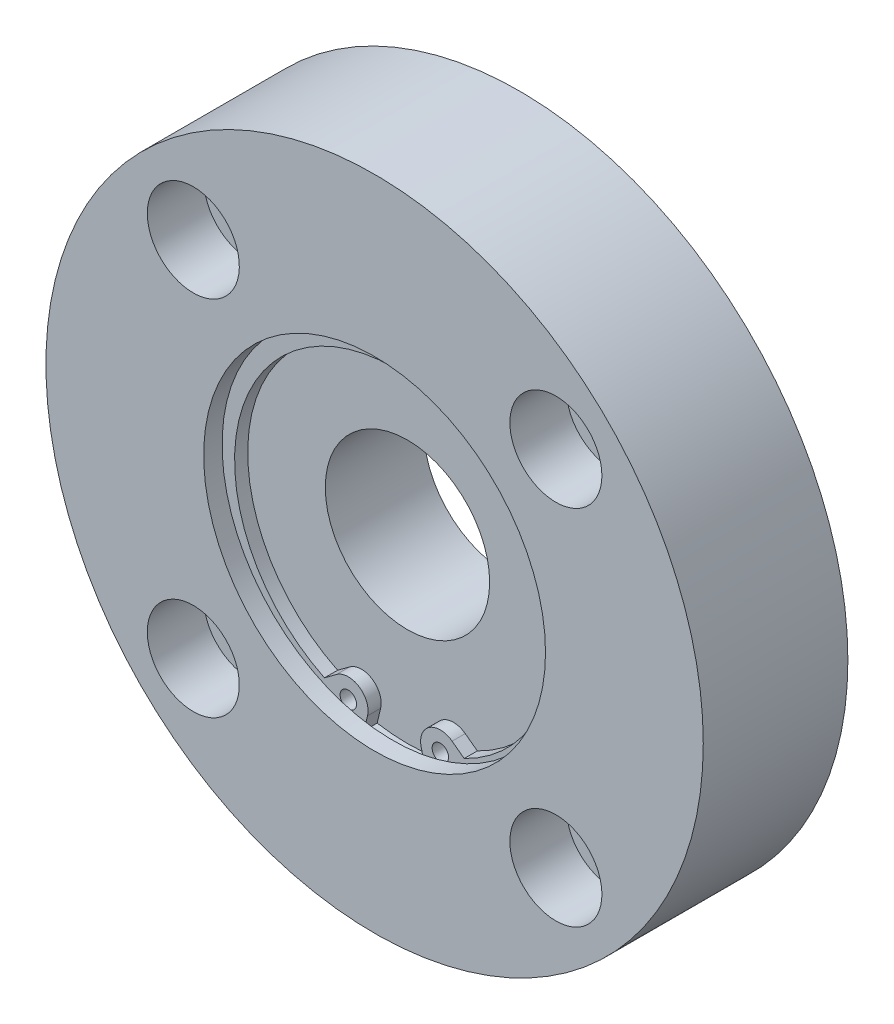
ISO-10303-21;
HEADER;
FILE_DESCRIPTION(('STEP AP214'),'2;1');
FILE_NAME('part.step','',(''),(''),'','','');
FILE_SCHEMA(('AUTOMOTIVE_DESIGN { 1 0 10303 214 1 1 1 1 }'));
ENDSEC;
DATA;
#1=APPLICATION_CONTEXT('core data for automotive mechanical design processes');
#2=APPLICATION_PROTOCOL_DEFINITION('international standard','automotive_design',2000,#1);
#3=PRODUCT_CONTEXT('',#1,'mechanical');
#4=PRODUCT('Part','Part','',(#3));
#5=PRODUCT_RELATED_PRODUCT_CATEGORY('part','',(#4));
#6=PRODUCT_DEFINITION_FORMATION('','',#4);
#7=PRODUCT_DEFINITION_CONTEXT('part definition',#1,'design');
#8=PRODUCT_DEFINITION('design','',#6,#7);
#9=PRODUCT_DEFINITION_SHAPE('','',#8);
#10=(LENGTH_UNIT() NAMED_UNIT(*) SI_UNIT(.MILLI.,.METRE.));
#11=(NAMED_UNIT(*) PLANE_ANGLE_UNIT() SI_UNIT($,.RADIAN.));
#12=(NAMED_UNIT(*) SI_UNIT($,.STERADIAN.) SOLID_ANGLE_UNIT());
#13=UNCERTAINTY_MEASURE_WITH_UNIT(LENGTH_MEASURE(1.E-05),#10,'distance_accuracy_value','');
#14=(GEOMETRIC_REPRESENTATION_CONTEXT(3) GLOBAL_UNCERTAINTY_ASSIGNED_CONTEXT((#13)) GLOBAL_UNIT_ASSIGNED_CONTEXT((#10,
#11,#12)) REPRESENTATION_CONTEXT('',''));
#15=CARTESIAN_POINT('',(0.,0.,0.));
#16=DIRECTION('',(0.,0.,1.));
#17=DIRECTION('',(1.,0.,0.));
#18=AXIS2_PLACEMENT_3D('',#15,#16,#17);
#19=CARTESIAN_POINT('',(27.5771644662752,27.5771644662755,0.));
#20=DIRECTION('',(0.,0.,1.));
#21=DIRECTION('',(1.,0.,0.));
#22=AXIS2_PLACEMENT_3D('',#19,#20,#21);
#23=CYLINDRICAL_SURFACE('',#22,5.);
#24=CARTESIAN_POINT('',(27.5771644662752,27.5771644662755,0.));
#25=DIRECTION('',(0.,0.,1.));
#26=DIRECTION('',(1.,0.,0.));
#27=AXIS2_PLACEMENT_3D('',#24,#25,#26);
#28=CIRCLE('',#27,5.);
#29=CARTESIAN_POINT('',(32.5771644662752,27.5771644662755,0.));
#30=VERTEX_POINT('',#29);
#31=EDGE_CURVE('E229',#30,#30,#28,.T.);
#32=ORIENTED_EDGE('',*,*,#31,.F.);
#33=EDGE_LOOP('',(#32));
#34=FACE_BOUND('',#33,.T.);
#35=CARTESIAN_POINT('',(27.5771644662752,27.5771644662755,13.4));
#36=DIRECTION('',(0.,0.,1.));
#37=DIRECTION('',(1.,0.,0.));
#38=AXIS2_PLACEMENT_3D('',#35,#36,#37);
#39=CIRCLE('',#38,5.);
#40=CARTESIAN_POINT('',(32.5771644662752,27.5771644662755,13.4));
#41=VERTEX_POINT('',#40);
#42=EDGE_CURVE('E228',#41,#41,#39,.F.);
#43=ORIENTED_EDGE('',*,*,#42,.F.);
#44=EDGE_LOOP('',(#43));
#45=FACE_BOUND('',#44,.T.);
#46=ADVANCED_FACE('F14',(#34,#45),#23,.F.);
#47=CARTESIAN_POINT('',(27.5771644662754,-27.5771644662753,0.));
#48=DIRECTION('',(0.,0.,1.));
#49=DIRECTION('',(1.,0.,0.));
#50=AXIS2_PLACEMENT_3D('',#47,#48,#49);
#51=CYLINDRICAL_SURFACE('',#50,5.);
#52=CARTESIAN_POINT('',(27.5771644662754,-27.5771644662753,0.));
#53=DIRECTION('',(0.,0.,1.));
#54=DIRECTION('',(0.,-1.,0.));
#55=AXIS2_PLACEMENT_3D('',#52,#53,#54);
#56=CIRCLE('',#55,5.);
#57=CARTESIAN_POINT('',(27.5771644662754,-32.5771644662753,0.));
#58=VERTEX_POINT('',#57);
#59=EDGE_CURVE('E219',#58,#58,#56,.T.);
#60=ORIENTED_EDGE('',*,*,#59,.F.);
#61=EDGE_LOOP('',(#60));
#62=FACE_BOUND('',#61,.T.);
#63=CARTESIAN_POINT('',(27.5771644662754,-27.5771644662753,13.4));
#64=DIRECTION('',(0.,0.,1.));
#65=DIRECTION('',(1.,0.,0.));
#66=AXIS2_PLACEMENT_3D('',#63,#64,#65);
#67=CIRCLE('',#66,5.);
#68=CARTESIAN_POINT('',(32.5771644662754,-27.5771644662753,13.4));
#69=VERTEX_POINT('',#68);
#70=EDGE_CURVE('E212',#69,#69,#67,.F.);
#71=ORIENTED_EDGE('',*,*,#70,.F.);
#72=EDGE_LOOP('',(#71));
#73=FACE_BOUND('',#72,.T.);
#74=ADVANCED_FACE('F319',(#62,#73),#51,.F.);
#75=CARTESIAN_POINT('',(-27.5771644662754,-27.5771644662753,0.));
#76=DIRECTION('',(0.,0.,1.));
#77=DIRECTION('',(1.,0.,0.));
#78=AXIS2_PLACEMENT_3D('',#75,#76,#77);
#79=CYLINDRICAL_SURFACE('',#78,5.);
#80=CARTESIAN_POINT('',(-27.5771644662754,-27.5771644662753,0.));
#81=DIRECTION('',(0.,0.,1.));
#82=DIRECTION('',(-1.,0.,0.));
#83=AXIS2_PLACEMENT_3D('',#80,#81,#82);
#84=CIRCLE('',#83,5.);
#85=CARTESIAN_POINT('',(-32.5771644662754,-27.5771644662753,0.));
#86=VERTEX_POINT('',#85);
#87=EDGE_CURVE('E216',#86,#86,#84,.T.);
#88=ORIENTED_EDGE('',*,*,#87,.F.);
#89=EDGE_LOOP('',(#88));
#90=FACE_BOUND('',#89,.T.);
#91=CARTESIAN_POINT('',(-27.5771644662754,-27.5771644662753,13.4));
#92=DIRECTION('',(0.,0.,1.));
#93=DIRECTION('',(1.,0.,0.));
#94=AXIS2_PLACEMENT_3D('',#91,#92,#93);
#95=CIRCLE('',#94,5.);
#96=CARTESIAN_POINT('',(-22.5771644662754,-27.5771644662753,13.4));
#97=VERTEX_POINT('',#96);
#98=EDGE_CURVE('E205',#97,#97,#95,.F.);
#99=ORIENTED_EDGE('',*,*,#98,.F.);
#100=EDGE_LOOP('',(#99));
#101=FACE_BOUND('',#100,.T.);
#102=ADVANCED_FACE('F325',(#90,#101),#79,.F.);
#103=CARTESIAN_POINT('',(-27.5771644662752,27.5771644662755,0.));
#104=DIRECTION('',(0.,0.,1.));
#105=DIRECTION('',(1.,0.,0.));
#106=AXIS2_PLACEMENT_3D('',#103,#104,#105);
#107=CYLINDRICAL_SURFACE('',#106,5.);
#108=CARTESIAN_POINT('',(-27.5771644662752,27.5771644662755,0.));
#109=DIRECTION('',(0.,0.,1.));
#110=DIRECTION('',(0.,1.,0.));
#111=AXIS2_PLACEMENT_3D('',#108,#109,#110);
#112=CIRCLE('',#111,5.);
#113=CARTESIAN_POINT('',(-27.5771644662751,32.5771644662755,0.));
#114=VERTEX_POINT('',#113);
#115=EDGE_CURVE('E213',#114,#114,#112,.T.);
#116=ORIENTED_EDGE('',*,*,#115,.F.);
#117=EDGE_LOOP('',(#116));
#118=FACE_BOUND('',#117,.T.);
#119=CARTESIAN_POINT('',(-27.5771644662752,27.5771644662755,13.4));
#120=DIRECTION('',(0.,0.,1.));
#121=DIRECTION('',(1.,0.,0.));
#122=AXIS2_PLACEMENT_3D('',#119,#120,#121);
#123=CIRCLE('',#122,5.);
#124=CARTESIAN_POINT('',(-22.5771644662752,27.5771644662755,13.4));
#125=VERTEX_POINT('',#124);
#126=EDGE_CURVE('E198',#125,#125,#123,.F.);
#127=ORIENTED_EDGE('',*,*,#126,.F.);
#128=EDGE_LOOP('',(#127));
#129=FACE_BOUND('',#128,.T.);
#130=ADVANCED_FACE('F421',(#118,#129),#107,.F.);
#131=CARTESIAN_POINT('',(27.5771644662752,27.5771644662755,13.4));
#132=DIRECTION('',(0.,0.,1.));
#133=DIRECTION('',(1.,0.,0.));
#134=AXIS2_PLACEMENT_3D('',#131,#132,#133);
#135=PLANE('',#134);
#136=CARTESIAN_POINT('',(27.5771644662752,27.5771644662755,13.4));
#137=DIRECTION('',(0.,0.,1.));
#138=DIRECTION('',(1.,0.,0.));
#139=AXIS2_PLACEMENT_3D('',#136,#137,#138);
#140=CIRCLE('',#139,7.);
#141=CARTESIAN_POINT('',(34.5771644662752,27.5771644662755,13.4));
#142=VERTEX_POINT('',#141);
#143=EDGE_CURVE('E225',#142,#142,#140,.T.);
#144=ORIENTED_EDGE('',*,*,#143,.T.);
#145=EDGE_LOOP('',(#144));
#146=FACE_BOUND('',#145,.T.);
#147=ORIENTED_EDGE('',*,*,#42,.T.);
#148=EDGE_LOOP('',(#147));
#149=FACE_BOUND('',#148,.T.);
#150=ADVANCED_FACE('F412',(#146,#149),#135,.T.);
#151=CARTESIAN_POINT('',(27.5771644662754,-27.5771644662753,13.4));
#152=DIRECTION('',(0.,0.,1.));
#153=DIRECTION('',(0.,-1.,0.));
#154=AXIS2_PLACEMENT_3D('',#151,#152,#153);
#155=PLANE('',#154);
#156=CARTESIAN_POINT('',(27.5771644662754,-27.5771644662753,13.4));
#157=DIRECTION('',(0.,0.,1.));
#158=DIRECTION('',(0.,-1.,0.));
#159=AXIS2_PLACEMENT_3D('',#156,#157,#158);
#160=CIRCLE('',#159,7.);
#161=CARTESIAN_POINT('',(27.5771644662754,-34.5771644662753,13.4));
#162=VERTEX_POINT('',#161);
#163=EDGE_CURVE('E209',#162,#162,#160,.T.);
#164=ORIENTED_EDGE('',*,*,#163,.T.);
#165=EDGE_LOOP('',(#164));
#166=FACE_BOUND('',#165,.T.);
#167=ORIENTED_EDGE('',*,*,#70,.T.);
#168=EDGE_LOOP('',(#167));
#169=FACE_BOUND('',#168,.T.);
#170=ADVANCED_FACE('F409',(#166,#169),#155,.T.);
#171=CARTESIAN_POINT('',(-27.5771644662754,-27.5771644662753,13.4));
#172=DIRECTION('',(0.,0.,1.));
#173=DIRECTION('',(-1.,0.,0.));
#174=AXIS2_PLACEMENT_3D('',#171,#172,#173);
#175=PLANE('',#174);
#176=CARTESIAN_POINT('',(-27.5771644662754,-27.5771644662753,13.4));
#177=DIRECTION('',(0.,0.,1.));
#178=DIRECTION('',(-1.,0.,0.));
#179=AXIS2_PLACEMENT_3D('',#176,#177,#178);
#180=CIRCLE('',#179,7.);
#181=CARTESIAN_POINT('',(-34.5771644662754,-27.5771644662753,13.4));
#182=VERTEX_POINT('',#181);
#183=EDGE_CURVE('E202',#182,#182,#180,.T.);
#184=ORIENTED_EDGE('',*,*,#183,.T.);
#185=EDGE_LOOP('',(#184));
#186=FACE_BOUND('',#185,.T.);
#187=ORIENTED_EDGE('',*,*,#98,.T.);
#188=EDGE_LOOP('',(#187));
#189=FACE_BOUND('',#188,.T.);
#190=ADVANCED_FACE('F411',(#186,#189),#175,.T.);
#191=CARTESIAN_POINT('',(-27.5771644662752,27.5771644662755,13.4));
#192=DIRECTION('',(0.,0.,1.));
#193=DIRECTION('',(0.,1.,0.));
#194=AXIS2_PLACEMENT_3D('',#191,#192,#193);
#195=PLANE('',#194);
#196=CARTESIAN_POINT('',(-27.5771644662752,27.5771644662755,13.4));
#197=DIRECTION('',(0.,0.,1.));
#198=DIRECTION('',(0.,1.,0.));
#199=AXIS2_PLACEMENT_3D('',#196,#197,#198);
#200=CIRCLE('',#199,7.);
#201=CARTESIAN_POINT('',(-27.5771644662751,34.5771644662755,13.4));
#202=VERTEX_POINT('',#201);
#203=EDGE_CURVE('E195',#202,#202,#200,.T.);
#204=ORIENTED_EDGE('',*,*,#203,.T.);
#205=EDGE_LOOP('',(#204));
#206=FACE_BOUND('',#205,.T.);
#207=ORIENTED_EDGE('',*,*,#126,.T.);
#208=EDGE_LOOP('',(#207));
#209=FACE_BOUND('',#208,.T.);
#210=ADVANCED_FACE('F343',(#206,#209),#195,.T.);
#211=CARTESIAN_POINT('',(0.,0.,0.));
#212=DIRECTION('',(0.,0.,1.));
#213=DIRECTION('',(1.,0.,0.));
#214=AXIS2_PLACEMENT_3D('',#211,#212,#213);
#215=PLANE('',#214);
#216=CARTESIAN_POINT('',(0.,0.,0.));
#217=DIRECTION('',(0.,0.,-1.));
#218=DIRECTION('',(-1.,0.,0.));
#219=AXIS2_PLACEMENT_3D('',#216,#217,#218);
#220=CIRCLE('',#219,22.5);
#221=CARTESIAN_POINT('',(-22.5,0.,0.));
#222=VERTEX_POINT('',#221);
#223=EDGE_CURVE('E181',#222,#222,#220,.T.);
#224=ORIENTED_EDGE('',*,*,#223,.F.);
#225=EDGE_LOOP('',(#224));
#226=FACE_BOUND('',#225,.T.);
#227=ORIENTED_EDGE('',*,*,#115,.T.);
#228=EDGE_LOOP('',(#227));
#229=FACE_BOUND('',#228,.T.);
#230=ORIENTED_EDGE('',*,*,#87,.T.);
#231=EDGE_LOOP('',(#230));
#232=FACE_BOUND('',#231,.T.);
#233=ORIENTED_EDGE('',*,*,#59,.T.);
#234=EDGE_LOOP('',(#233));
#235=FACE_BOUND('',#234,.T.);
#236=ORIENTED_EDGE('',*,*,#31,.T.);
#237=EDGE_LOOP('',(#236));
#238=FACE_BOUND('',#237,.T.);
#239=CARTESIAN_POINT('',(0.,0.,0.));
#240=DIRECTION('',(0.,0.,1.));
#241=DIRECTION('',(1.,0.,0.));
#242=AXIS2_PLACEMENT_3D('',#239,#240,#241);
#243=CIRCLE('',#242,50.);
#244=CARTESIAN_POINT('',(50.,0.,0.));
#245=VERTEX_POINT('',#244);
#246=EDGE_CURVE('E232',#245,#245,#243,.T.);
#247=ORIENTED_EDGE('',*,*,#246,.F.);
#248=EDGE_LOOP('',(#247));
#249=FACE_BOUND('',#248,.T.);
#250=ADVANCED_FACE('F339',(#226,#229,#232,#235,#238,#249),#215,.F.);
#251=CARTESIAN_POINT('',(0.,0.,22.));
#252=DIRECTION('',(0.,0.,-1.));
#253=DIRECTION('',(-1.,0.,0.));
#254=AXIS2_PLACEMENT_3D('',#251,#252,#253);
#255=CYLINDRICAL_SURFACE('',#254,50.);
#256=CARTESIAN_POINT('',(0.,0.,22.));
#257=DIRECTION('',(0.,0.,1.));
#258=DIRECTION('',(1.,0.,0.));
#259=AXIS2_PLACEMENT_3D('',#256,#257,#258);
#260=CIRCLE('',#259,50.);
#261=CARTESIAN_POINT('',(50.,0.,22.));
#262=VERTEX_POINT('',#261);
#263=EDGE_CURVE('E235',#262,#262,#260,.T.);
#264=ORIENTED_EDGE('',*,*,#263,.F.);
#265=EDGE_LOOP('',(#264));
#266=FACE_BOUND('',#265,.T.);
#267=ORIENTED_EDGE('',*,*,#246,.T.);
#268=EDGE_LOOP('',(#267));
#269=FACE_BOUND('',#268,.T.);
#270=ADVANCED_FACE('F342',(#266,#269),#255,.T.);
#271=CARTESIAN_POINT('',(27.5771644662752,27.5771644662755,13.4));
#272=DIRECTION('',(0.,0.,1.));
#273=DIRECTION('',(1.,0.,0.));
#274=AXIS2_PLACEMENT_3D('',#271,#272,#273);
#275=CYLINDRICAL_SURFACE('',#274,7.);
#276=ORIENTED_EDGE('',*,*,#143,.F.);
#277=EDGE_LOOP('',(#276));
#278=FACE_BOUND('',#277,.T.);
#279=CARTESIAN_POINT('',(27.5771644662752,27.5771644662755,22.));
#280=DIRECTION('',(0.,0.,1.));
#281=DIRECTION('',(1.,0.,0.));
#282=AXIS2_PLACEMENT_3D('',#279,#280,#281);
#283=CIRCLE('',#282,7.);
#284=CARTESIAN_POINT('',(34.5771644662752,27.5771644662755,22.));
#285=VERTEX_POINT('',#284);
#286=EDGE_CURVE('E222',#285,#285,#283,.T.);
#287=ORIENTED_EDGE('',*,*,#286,.T.);
#288=EDGE_LOOP('',(#287));
#289=FACE_BOUND('',#288,.T.);
#290=ADVANCED_FACE('F332',(#278,#289),#275,.F.);
#291=CARTESIAN_POINT('',(27.5771644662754,-27.5771644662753,13.4));
#292=DIRECTION('',(0.,0.,1.));
#293=DIRECTION('',(1.,0.,0.));
#294=AXIS2_PLACEMENT_3D('',#291,#292,#293);
#295=CYLINDRICAL_SURFACE('',#294,7.);
#296=ORIENTED_EDGE('',*,*,#163,.F.);
#297=EDGE_LOOP('',(#296));
#298=FACE_BOUND('',#297,.T.);
#299=CARTESIAN_POINT('',(27.5771644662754,-27.5771644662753,22.));
#300=DIRECTION('',(0.,0.,1.));
#301=DIRECTION('',(0.,-1.,0.));
#302=AXIS2_PLACEMENT_3D('',#299,#300,#301);
#303=CIRCLE('',#302,7.);
#304=CARTESIAN_POINT('',(27.5771644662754,-34.5771644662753,22.));
#305=VERTEX_POINT('',#304);
#306=EDGE_CURVE('E206',#305,#305,#303,.T.);
#307=ORIENTED_EDGE('',*,*,#306,.T.);
#308=EDGE_LOOP('',(#307));
#309=FACE_BOUND('',#308,.T.);
#310=ADVANCED_FACE('F426',(#298,#309),#295,.F.);
#311=CARTESIAN_POINT('',(-27.5771644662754,-27.5771644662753,13.4));
#312=DIRECTION('',(0.,0.,1.));
#313=DIRECTION('',(1.,0.,0.));
#314=AXIS2_PLACEMENT_3D('',#311,#312,#313);
#315=CYLINDRICAL_SURFACE('',#314,7.);
#316=ORIENTED_EDGE('',*,*,#183,.F.);
#317=EDGE_LOOP('',(#316));
#318=FACE_BOUND('',#317,.T.);
#319=CARTESIAN_POINT('',(-27.5771644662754,-27.5771644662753,22.));
#320=DIRECTION('',(0.,0.,1.));
#321=DIRECTION('',(-1.,0.,0.));
#322=AXIS2_PLACEMENT_3D('',#319,#320,#321);
#323=CIRCLE('',#322,7.);
#324=CARTESIAN_POINT('',(-34.5771644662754,-27.5771644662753,22.));
#325=VERTEX_POINT('',#324);
#326=EDGE_CURVE('E199',#325,#325,#323,.T.);
#327=ORIENTED_EDGE('',*,*,#326,.T.);
#328=EDGE_LOOP('',(#327));
#329=FACE_BOUND('',#328,.T.);
#330=ADVANCED_FACE('F425',(#318,#329),#315,.F.);
#331=CARTESIAN_POINT('',(-27.5771644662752,27.5771644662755,13.4));
#332=DIRECTION('',(0.,0.,1.));
#333=DIRECTION('',(1.,0.,0.));
#334=AXIS2_PLACEMENT_3D('',#331,#332,#333);
#335=CYLINDRICAL_SURFACE('',#334,7.);
#336=ORIENTED_EDGE('',*,*,#203,.F.);
#337=EDGE_LOOP('',(#336));
#338=FACE_BOUND('',#337,.T.);
#339=CARTESIAN_POINT('',(-27.5771644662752,27.5771644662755,22.));
#340=DIRECTION('',(0.,0.,1.));
#341=DIRECTION('',(0.,1.,0.));
#342=AXIS2_PLACEMENT_3D('',#339,#340,#341);
#343=CIRCLE('',#342,7.);
#344=CARTESIAN_POINT('',(-27.5771644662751,34.5771644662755,22.));
#345=VERTEX_POINT('',#344);
#346=EDGE_CURVE('E192',#345,#345,#343,.T.);
#347=ORIENTED_EDGE('',*,*,#346,.T.);
#348=EDGE_LOOP('',(#347));
#349=FACE_BOUND('',#348,.T.);
#350=ADVANCED_FACE('F394',(#338,#349),#335,.F.);
#351=CARTESIAN_POINT('',(0.,0.,2.));
#352=DIRECTION('',(0.,0.,-1.));
#353=DIRECTION('',(-1.,0.,0.));
#354=AXIS2_PLACEMENT_3D('',#351,#352,#353);
#355=CYLINDRICAL_SURFACE('',#354,22.5);
#356=CARTESIAN_POINT('',(0.,0.,2.));
#357=DIRECTION('',(0.,0.,-1.));
#358=DIRECTION('',(-1.,0.,0.));
#359=AXIS2_PLACEMENT_3D('',#356,#357,#358);
#360=CIRCLE('',#359,22.5);
#361=CARTESIAN_POINT('',(-22.5,0.,2.));
#362=VERTEX_POINT('',#361);
#363=EDGE_CURVE('E184',#362,#362,#360,.T.);
#364=ORIENTED_EDGE('',*,*,#363,.F.);
#365=EDGE_LOOP('',(#364));
#366=FACE_BOUND('',#365,.T.);
#367=ORIENTED_EDGE('',*,*,#223,.T.);
#368=EDGE_LOOP('',(#367));
#369=FACE_BOUND('',#368,.T.);
#370=ADVANCED_FACE('F349',(#366,#369),#355,.F.);
#371=CARTESIAN_POINT('',(0.,0.,22.));
#372=DIRECTION('',(0.,0.,1.));
#373=DIRECTION('',(1.,0.,0.));
#374=AXIS2_PLACEMENT_3D('',#371,#372,#373);
#375=PLANE('',#374);
#376=CARTESIAN_POINT('',(0.,0.,22.));
#377=DIRECTION('',(0.,0.,1.));
#378=DIRECTION('',(1.,0.,0.));
#379=AXIS2_PLACEMENT_3D('',#376,#377,#378);
#380=CIRCLE('',#379,26.);
#381=CARTESIAN_POINT('',(26.,0.,22.));
#382=VERTEX_POINT('',#381);
#383=EDGE_CURVE('E188',#382,#382,#380,.T.);
#384=ORIENTED_EDGE('',*,*,#383,.F.);
#385=EDGE_LOOP('',(#384));
#386=FACE_BOUND('',#385,.T.);
#387=ORIENTED_EDGE('',*,*,#346,.F.);
#388=EDGE_LOOP('',(#387));
#389=FACE_BOUND('',#388,.T.);
#390=ORIENTED_EDGE('',*,*,#326,.F.);
#391=EDGE_LOOP('',(#390));
#392=FACE_BOUND('',#391,.T.);
#393=ORIENTED_EDGE('',*,*,#306,.F.);
#394=EDGE_LOOP('',(#393));
#395=FACE_BOUND('',#394,.T.);
#396=ORIENTED_EDGE('',*,*,#286,.F.);
#397=EDGE_LOOP('',(#396));
#398=FACE_BOUND('',#397,.T.);
#399=ORIENTED_EDGE('',*,*,#263,.T.);
#400=EDGE_LOOP('',(#399));
#401=FACE_BOUND('',#400,.T.);
#402=ADVANCED_FACE('F345',(#386,#389,#392,#395,#398,#401),#375,.T.);
#403=CARTESIAN_POINT('',(0.,0.,2.));
#404=DIRECTION('',(0.,0.,-1.));
#405=DIRECTION('',(-1.,0.,0.));
#406=AXIS2_PLACEMENT_3D('',#403,#404,#405);
#407=PLANE('',#406);
#408=CARTESIAN_POINT('',(0.,0.,2.));
#409=DIRECTION('',(0.,0.,-1.));
#410=DIRECTION('',(-1.,0.,0.));
#411=AXIS2_PLACEMENT_3D('',#408,#409,#410);
#412=CIRCLE('',#411,12.5);
#413=CARTESIAN_POINT('',(-12.5,0.,2.));
#414=VERTEX_POINT('',#413);
#415=EDGE_CURVE('E187',#414,#414,#412,.T.);
#416=ORIENTED_EDGE('',*,*,#415,.F.);
#417=EDGE_LOOP('',(#416));
#418=FACE_BOUND('',#417,.T.);
#419=ORIENTED_EDGE('',*,*,#363,.T.);
#420=EDGE_LOOP('',(#419));
#421=FACE_BOUND('',#420,.T.);
#422=ADVANCED_FACE('F348',(#418,#421),#407,.T.);
#423=CARTESIAN_POINT('',(0.,0.,17.));
#424=DIRECTION('',(0.,0.,1.));
#425=DIRECTION('',(1.,0.,0.));
#426=AXIS2_PLACEMENT_3D('',#423,#424,#425);
#427=CYLINDRICAL_SURFACE('',#426,26.);
#428=CARTESIAN_POINT('',(0.,0.,19.2));
#429=DIRECTION('',(0.,0.,1.));
#430=DIRECTION('',(1.,0.,0.));
#431=AXIS2_PLACEMENT_3D('',#428,#429,#430);
#432=CIRCLE('',#431,26.);
#433=CARTESIAN_POINT('',(26.,0.,19.2));
#434=VERTEX_POINT('',#433);
#435=EDGE_CURVE('E178',#434,#434,#432,.F.);
#436=ORIENTED_EDGE('',*,*,#435,.T.);
#437=EDGE_LOOP('',(#436));
#438=FACE_BOUND('',#437,.T.);
#439=ORIENTED_EDGE('',*,*,#383,.T.);
#440=EDGE_LOOP('',(#439));
#441=FACE_BOUND('',#440,.T.);
#442=ADVANCED_FACE('F337',(#438,#441),#427,.F.);
#443=CARTESIAN_POINT('',(0.,0.,22.));
#444=DIRECTION('',(0.,0.,-1.));
#445=DIRECTION('',(-1.,0.,0.));
#446=AXIS2_PLACEMENT_3D('',#443,#444,#445);
#447=CYLINDRICAL_SURFACE('',#446,12.5);
#448=CARTESIAN_POINT('',(0.,0.,17.));
#449=DIRECTION('',(0.,0.,1.));
#450=DIRECTION('',(1.,0.,0.));
#451=AXIS2_PLACEMENT_3D('',#448,#449,#450);
#452=CIRCLE('',#451,12.5);
#453=CARTESIAN_POINT('',(12.5,0.,17.));
#454=VERTEX_POINT('',#453);
#455=EDGE_CURVE('E191',#454,#454,#452,.T.);
#456=ORIENTED_EDGE('',*,*,#455,.T.);
#457=EDGE_LOOP('',(#456));
#458=FACE_BOUND('',#457,.T.);
#459=ORIENTED_EDGE('',*,*,#415,.T.);
#460=EDGE_LOOP('',(#459));
#461=FACE_BOUND('',#460,.T.);
#462=ADVANCED_FACE('F334',(#458,#461),#447,.F.);
#463=CARTESIAN_POINT('',(0.,0.,17.));
#464=DIRECTION('',(0.,0.,1.));
#465=DIRECTION('',(1.,0.,0.));
#466=AXIS2_PLACEMENT_3D('',#463,#464,#465);
#467=PLANE('',#466);
#468=ORIENTED_EDGE('',*,*,#455,.F.);
#469=EDGE_LOOP('',(#468));
#470=FACE_BOUND('',#469,.T.);
#471=CARTESIAN_POINT('',(0.,0.,17.));
#472=DIRECTION('',(0.,0.,1.));
#473=DIRECTION('',(1.,0.,0.));
#474=AXIS2_PLACEMENT_3D('',#471,#472,#473);
#475=CIRCLE('',#474,27.5);
#476=CARTESIAN_POINT('',(-4.60954752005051,-27.1109216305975,17.));
#477=VERTEX_POINT('',#476);
#478=CARTESIAN_POINT('',(4.60954752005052,-27.1109216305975,17.));
#479=VERTEX_POINT('',#478);
#480=EDGE_CURVE('E97',#477,#479,#475,.T.);
#481=ORIENTED_EDGE('',*,*,#480,.T.);
#482=DIRECTION('',(-0.231349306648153,0.972870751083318,0.));
#483=VECTOR('',#482,1.);
#484=CARTESIAN_POINT('',(-1.73910274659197,-0.413559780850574,17.));
#485=LINE('',#484,#483);
#486=CARTESIAN_POINT('',(4.08138774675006,-24.8899026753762,17.));
#487=VERTEX_POINT('',#486);
#488=EDGE_CURVE('E9',#479,#487,#485,.T.);
#489=ORIENTED_EDGE('',*,*,#488,.T.);
#490=CARTESIAN_POINT('',(7.,-24.1958547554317,17.));
#491=DIRECTION('',(0.,0.,1.));
#492=DIRECTION('',(1.,0.,0.));
#493=AXIS2_PLACEMENT_3D('',#490,#491,#492);
#494=CIRCLE('',#493,3.);
#495=CARTESIAN_POINT('',(8.7896612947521,-21.7881354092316,17.));
#496=VERTEX_POINT('',#495);
#497=EDGE_CURVE('E25',#496,#487,#494,.T.);
#498=ORIENTED_EDGE('',*,*,#497,.F.);
#499=DIRECTION('',(0.802573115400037,-0.596553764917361,0.));
#500=VECTOR('',#499,1.);
#501=CARTESIAN_POINT('',(-7.30364722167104,-9.82595576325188,17.));
#502=LINE('',#501,#500);
#503=CARTESIAN_POINT('',(10.6263840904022,-23.1533741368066,17.));
#504=VERTEX_POINT('',#503);
#505=EDGE_CURVE('E269',#496,#504,#502,.T.);
#506=ORIENTED_EDGE('',*,*,#505,.T.);
#507=CARTESIAN_POINT('',(0.,-1.3,17.));
#508=DIRECTION('',(0.,0.,1.));
#509=DIRECTION('',(1.,0.,0.));
#510=AXIS2_PLACEMENT_3D('',#507,#508,#509);
#511=CIRCLE('',#510,24.3);
#512=CARTESIAN_POINT('',(-10.6263840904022,-23.1533741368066,17.));
#513=VERTEX_POINT('',#512);
#514=EDGE_CURVE('E133',#504,#513,#511,.T.);
#515=ORIENTED_EDGE('',*,*,#514,.T.);
#516=DIRECTION('',(0.802573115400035,0.596553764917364,0.));
#517=VECTOR('',#516,1.);
#518=CARTESIAN_POINT('',(7.30364722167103,-9.8259557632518,17.));
#519=LINE('',#518,#517);
#520=CARTESIAN_POINT('',(-8.7896612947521,-21.7881354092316,17.));
#521=VERTEX_POINT('',#520);
#522=EDGE_CURVE('E265',#513,#521,#519,.T.);
#523=ORIENTED_EDGE('',*,*,#522,.T.);
#524=CARTESIAN_POINT('',(-7.,-24.1958547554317,17.));
#525=DIRECTION('',(0.,0.,1.));
#526=DIRECTION('',(1.,0.,0.));
#527=AXIS2_PLACEMENT_3D('',#524,#525,#526);
#528=CIRCLE('',#527,3.);
#529=CARTESIAN_POINT('',(-4.08138774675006,-24.8899026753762,17.));
#530=VERTEX_POINT('',#529);
#531=EDGE_CURVE('E95',#530,#521,#528,.T.);
#532=ORIENTED_EDGE('',*,*,#531,.F.);
#533=DIRECTION('',(-0.231349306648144,-0.97287075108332,0.));
#534=VECTOR('',#533,1.);
#535=CARTESIAN_POINT('',(1.73910274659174,-0.413559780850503,17.));
#536=LINE('',#535,#534);
#537=EDGE_CURVE('E174',#530,#477,#536,.T.);
#538=ORIENTED_EDGE('',*,*,#537,.T.);
#539=EDGE_LOOP('',(#481,#489,#498,#506,#515,#523,#532,#538));
#540=FACE_BOUND('',#539,.T.);
#541=ADVANCED_FACE('F172',(#470,#540),#467,.T.);
#542=CARTESIAN_POINT('',(0.,0.,19.2));
#543=DIRECTION('',(0.,0.,1.));
#544=DIRECTION('',(1.,0.,0.));
#545=AXIS2_PLACEMENT_3D('',#542,#543,#544);
#546=PLANE('',#545);
#547=CARTESIAN_POINT('',(0.,0.,19.2));
#548=DIRECTION('',(0.,0.,1.));
#549=DIRECTION('',(1.,0.,0.));
#550=AXIS2_PLACEMENT_3D('',#547,#548,#549);
#551=CIRCLE('',#550,27.5);
#552=CARTESIAN_POINT('',(27.5,0.,19.2));
#553=VERTEX_POINT('',#552);
#554=EDGE_CURVE('E175',#553,#553,#551,.T.);
#555=ORIENTED_EDGE('',*,*,#554,.F.);
#556=EDGE_LOOP('',(#555));
#557=FACE_BOUND('',#556,.T.);
#558=ORIENTED_EDGE('',*,*,#435,.F.);
#559=EDGE_LOOP('',(#558));
#560=FACE_BOUND('',#559,.T.);
#561=ADVANCED_FACE('F376',(#557,#560),#546,.F.);
#562=CARTESIAN_POINT('',(0.,0.,19.2));
#563=DIRECTION('',(0.,0.,-1.));
#564=DIRECTION('',(-1.,0.,0.));
#565=AXIS2_PLACEMENT_3D('',#562,#563,#564);
#566=CYLINDRICAL_SURFACE('',#565,27.5);
#567=ORIENTED_EDGE('',*,*,#554,.T.);
#568=EDGE_LOOP('',(#567));
#569=FACE_BOUND('',#568,.T.);
#570=CARTESIAN_POINT('',(0.,0.,19.));
#571=DIRECTION('',(0.,0.,-1.));
#572=DIRECTION('',(-1.,0.,0.));
#573=AXIS2_PLACEMENT_3D('',#570,#571,#572);
#574=CIRCLE('',#573,27.5);
#575=CARTESIAN_POINT('',(-4.60954752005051,-27.1109216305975,19.));
#576=VERTEX_POINT('',#575);
#577=CARTESIAN_POINT('',(4.60954752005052,-27.1109216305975,19.));
#578=VERTEX_POINT('',#577);
#579=EDGE_CURVE('E163',#576,#578,#574,.T.);
#580=ORIENTED_EDGE('',*,*,#579,.T.);
#581=DIRECTION('',(0.,0.,-1.));
#582=VECTOR('',#581,1.);
#583=CARTESIAN_POINT('',(4.60954752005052,-27.1109216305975,19.2));
#584=LINE('',#583,#582);
#585=EDGE_CURVE('E159',#578,#479,#584,.T.);
#586=ORIENTED_EDGE('',*,*,#585,.T.);
#587=ORIENTED_EDGE('',*,*,#480,.F.);
#588=DIRECTION('',(0.,0.,-1.));
#589=VECTOR('',#588,1.);
#590=CARTESIAN_POINT('',(-4.60954752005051,-27.1109216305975,19.2));
#591=LINE('',#590,#589);
#592=EDGE_CURVE('E238',#477,#576,#591,.F.);
#593=ORIENTED_EDGE('',*,*,#592,.T.);
#594=EDGE_LOOP('',(#580,#586,#587,#593));
#595=FACE_BOUND('',#594,.T.);
#596=ADVANCED_FACE('F161',(#569,#595),#566,.F.);
#597=CARTESIAN_POINT('',(7.,-24.1958547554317,17.));
#598=DIRECTION('',(0.,0.,1.));
#599=DIRECTION('',(1.,0.,0.));
#600=AXIS2_PLACEMENT_3D('',#597,#598,#599);
#601=CIRCLE('',#600,1.25);
#602=CARTESIAN_POINT('',(8.25,-24.1958547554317,17.));
#603=VERTEX_POINT('',#602);
#604=EDGE_CURVE('E166',#603,#603,#601,.T.);
#605=ORIENTED_EDGE('',*,*,#604,.T.);
#606=EDGE_LOOP('',(#605));
#607=FACE_BOUND('',#606,.T.);
#608=ADVANCED_FACE('F313',(#607),#467,.T.);
#609=CARTESIAN_POINT('',(-7.,-24.1958547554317,17.));
#610=DIRECTION('',(0.,0.,1.));
#611=DIRECTION('',(1.,0.,0.));
#612=AXIS2_PLACEMENT_3D('',#609,#610,#611);
#613=CIRCLE('',#612,1.25);
#614=CARTESIAN_POINT('',(-5.75,-24.1958547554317,17.));
#615=VERTEX_POINT('',#614);
#616=EDGE_CURVE('E258',#615,#615,#613,.T.);
#617=ORIENTED_EDGE('',*,*,#616,.T.);
#618=EDGE_LOOP('',(#617));
#619=FACE_BOUND('',#618,.T.);
#620=ADVANCED_FACE('F363',(#619),#467,.T.);
#621=CARTESIAN_POINT('',(8.7896612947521,-21.7881354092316,19.));
#622=DIRECTION('',(-0.596553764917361,-0.802573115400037,0.));
#623=DIRECTION('',(-0.802573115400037,0.596553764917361,0.));
#624=AXIS2_PLACEMENT_3D('',#621,#622,#623);
#625=PLANE('',#624);
#626=ORIENTED_EDGE('',*,*,#505,.F.);
#627=DIRECTION('',(0.,0.,-1.));
#628=VECTOR('',#627,1.);
#629=CARTESIAN_POINT('',(8.7896612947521,-21.7881354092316,19.));
#630=LINE('',#629,#628);
#631=CARTESIAN_POINT('',(8.7896612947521,-21.7881354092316,19.));
#632=VERTEX_POINT('',#631);
#633=EDGE_CURVE('E112',#632,#496,#630,.T.);
#634=ORIENTED_EDGE('',*,*,#633,.F.);
#635=DIRECTION('',(-0.802573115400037,0.596553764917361,0.));
#636=VECTOR('',#635,1.);
#637=CARTESIAN_POINT('',(8.7896612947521,-21.7881354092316,19.));
#638=LINE('',#637,#636);
#639=CARTESIAN_POINT('',(10.6263840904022,-23.1533741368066,19.));
#640=VERTEX_POINT('',#639);
#641=EDGE_CURVE('E120',#640,#632,#638,.T.);
#642=ORIENTED_EDGE('',*,*,#641,.F.);
#643=DIRECTION('',(0.,0.,-1.));
#644=VECTOR('',#643,1.);
#645=CARTESIAN_POINT('',(10.6263840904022,-23.1533741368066,19.));
#646=LINE('',#645,#644);
#647=EDGE_CURVE('E85',#640,#504,#646,.T.);
#648=ORIENTED_EDGE('',*,*,#647,.T.);
#649=EDGE_LOOP('',(#626,#634,#642,#648));
#650=FACE_BOUND('',#649,.T.);
#651=ADVANCED_FACE('F288',(#650),#625,.F.);
#652=CARTESIAN_POINT('',(0.,-1.3,19.));
#653=DIRECTION('',(0.,0.,1.));
#654=DIRECTION('',(-1.,0.,0.));
#655=AXIS2_PLACEMENT_3D('',#652,#653,#654);
#656=CYLINDRICAL_SURFACE('',#655,24.3);
#657=ORIENTED_EDGE('',*,*,#514,.F.);
#658=ORIENTED_EDGE('',*,*,#647,.F.);
#659=CARTESIAN_POINT('',(0.,-1.3,19.));
#660=DIRECTION('',(0.,0.,-1.));
#661=DIRECTION('',(0.,-1.,0.));
#662=AXIS2_PLACEMENT_3D('',#659,#660,#661);
#663=CIRCLE('',#662,24.3);
#664=CARTESIAN_POINT('',(-10.6263840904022,-23.1533741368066,19.));
#665=VERTEX_POINT('',#664);
#666=EDGE_CURVE('E86',#665,#640,#663,.T.);
#667=ORIENTED_EDGE('',*,*,#666,.F.);
#668=DIRECTION('',(0.,0.,-1.));
#669=VECTOR('',#668,1.);
#670=CARTESIAN_POINT('',(-10.6263840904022,-23.1533741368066,19.));
#671=LINE('',#670,#669);
#672=EDGE_CURVE('E82',#665,#513,#671,.T.);
#673=ORIENTED_EDGE('',*,*,#672,.T.);
#674=EDGE_LOOP('',(#657,#658,#667,#673));
#675=FACE_BOUND('',#674,.T.);
#676=ADVANCED_FACE('F130',(#675),#656,.F.);
#677=CARTESIAN_POINT('',(-8.7896612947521,-21.7881354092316,19.));
#678=DIRECTION('',(0.596553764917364,-0.802573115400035,0.));
#679=DIRECTION('',(0.,0.,-1.));
#680=AXIS2_PLACEMENT_3D('',#677,#678,#679);
#681=PLANE('',#680);
#682=ORIENTED_EDGE('',*,*,#522,.F.);
#683=ORIENTED_EDGE('',*,*,#672,.F.);
#684=DIRECTION('',(-0.802573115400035,-0.596553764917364,0.));
#685=VECTOR('',#684,1.);
#686=CARTESIAN_POINT('',(-8.7896612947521,-21.7881354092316,19.));
#687=LINE('',#686,#685);
#688=CARTESIAN_POINT('',(-8.7896612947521,-21.7881354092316,19.));
#689=VERTEX_POINT('',#688);
#690=EDGE_CURVE('E68',#689,#665,#687,.T.);
#691=ORIENTED_EDGE('',*,*,#690,.F.);
#692=DIRECTION('',(0.,0.,-1.));
#693=VECTOR('',#692,1.);
#694=CARTESIAN_POINT('',(-8.7896612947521,-21.7881354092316,19.));
#695=LINE('',#694,#693);
#696=EDGE_CURVE('E80',#689,#521,#695,.T.);
#697=ORIENTED_EDGE('',*,*,#696,.T.);
#698=EDGE_LOOP('',(#682,#683,#691,#697));
#699=FACE_BOUND('',#698,.T.);
#700=ADVANCED_FACE('F78',(#699),#681,.F.);
#701=CARTESIAN_POINT('',(-7.,-24.1958547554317,19.));
#702=DIRECTION('',(0.,0.,1.));
#703=DIRECTION('',(-1.,0.,0.));
#704=AXIS2_PLACEMENT_3D('',#701,#702,#703);
#705=CYLINDRICAL_SURFACE('',#704,1.25);
#706=ORIENTED_EDGE('',*,*,#616,.F.);
#707=EDGE_LOOP('',(#706));
#708=FACE_BOUND('',#707,.T.);
#709=CARTESIAN_POINT('',(-7.,-24.1958547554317,19.));
#710=DIRECTION('',(0.,0.,-1.));
#711=DIRECTION('',(1.,0.,0.));
#712=AXIS2_PLACEMENT_3D('',#709,#710,#711);
#713=CIRCLE('',#712,1.25);
#714=CARTESIAN_POINT('',(-5.75,-24.1958547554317,19.));
#715=VERTEX_POINT('',#714);
#716=EDGE_CURVE('E104',#715,#715,#713,.T.);
#717=ORIENTED_EDGE('',*,*,#716,.F.);
#718=EDGE_LOOP('',(#717));
#719=FACE_BOUND('',#718,.T.);
#720=ADVANCED_FACE('F16',(#708,#719),#705,.F.);
#721=CARTESIAN_POINT('',(7.,-24.1958547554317,19.));
#722=DIRECTION('',(0.,0.,1.));
#723=DIRECTION('',(-1.,0.,0.));
#724=AXIS2_PLACEMENT_3D('',#721,#722,#723);
#725=CYLINDRICAL_SURFACE('',#724,1.25);
#726=ORIENTED_EDGE('',*,*,#604,.F.);
#727=EDGE_LOOP('',(#726));
#728=FACE_BOUND('',#727,.T.);
#729=CARTESIAN_POINT('',(7.,-24.1958547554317,19.));
#730=DIRECTION('',(0.,0.,1.));
#731=DIRECTION('',(1.,0.,0.));
#732=AXIS2_PLACEMENT_3D('',#729,#730,#731);
#733=CIRCLE('',#732,1.25);
#734=CARTESIAN_POINT('',(8.25,-24.1958547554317,19.));
#735=VERTEX_POINT('',#734);
#736=EDGE_CURVE('E116',#735,#735,#733,.T.);
#737=ORIENTED_EDGE('',*,*,#736,.T.);
#738=EDGE_LOOP('',(#737));
#739=FACE_BOUND('',#738,.T.);
#740=ADVANCED_FACE('F298',(#728,#739),#725,.F.);
#741=CARTESIAN_POINT('',(7.,-24.1958547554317,19.));
#742=DIRECTION('',(0.,0.,1.));
#743=DIRECTION('',(-1.,0.,0.));
#744=AXIS2_PLACEMENT_3D('',#741,#742,#743);
#745=CYLINDRICAL_SURFACE('',#744,3.);
#746=ORIENTED_EDGE('',*,*,#497,.T.);
#747=DIRECTION('',(0.,0.,-1.));
#748=VECTOR('',#747,1.);
#749=CARTESIAN_POINT('',(4.08138774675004,-24.8899026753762,19.));
#750=LINE('',#749,#748);
#751=CARTESIAN_POINT('',(4.08138774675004,-24.8899026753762,19.));
#752=VERTEX_POINT('',#751);
#753=EDGE_CURVE('E170',#752,#487,#750,.T.);
#754=ORIENTED_EDGE('',*,*,#753,.F.);
#755=CARTESIAN_POINT('',(7.,-24.1958547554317,19.));
#756=DIRECTION('',(0.,0.,1.));
#757=DIRECTION('',(1.,0.,0.));
#758=AXIS2_PLACEMENT_3D('',#755,#756,#757);
#759=CIRCLE('',#758,3.);
#760=EDGE_CURVE('E123',#632,#752,#759,.T.);
#761=ORIENTED_EDGE('',*,*,#760,.F.);
#762=ORIENTED_EDGE('',*,*,#633,.T.);
#763=EDGE_LOOP('',(#746,#754,#761,#762));
#764=FACE_BOUND('',#763,.T.);
#765=ADVANCED_FACE('F289',(#764),#745,.T.);
#766=CARTESIAN_POINT('',(0.,-1.3,19.));
#767=DIRECTION('',(0.,0.,-1.));
#768=DIRECTION('',(0.,-1.,0.));
#769=AXIS2_PLACEMENT_3D('',#766,#767,#768);
#770=PLANE('',#769);
#771=ORIENTED_EDGE('',*,*,#736,.F.);
#772=EDGE_LOOP('',(#771));
#773=FACE_BOUND('',#772,.T.);
#774=ORIENTED_EDGE('',*,*,#716,.T.);
#775=EDGE_LOOP('',(#774));
#776=FACE_BOUND('',#775,.T.);
#777=ORIENTED_EDGE('',*,*,#579,.F.);
#778=DIRECTION('',(0.231349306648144,0.97287075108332,0.));
#779=VECTOR('',#778,1.);
#780=CARTESIAN_POINT('',(-4.08138774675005,-24.8899026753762,19.));
#781=LINE('',#780,#779);
#782=CARTESIAN_POINT('',(-4.08138774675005,-24.8899026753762,19.));
#783=VERTEX_POINT('',#782);
#784=EDGE_CURVE('E102',#576,#783,#781,.T.);
#785=ORIENTED_EDGE('',*,*,#784,.T.);
#786=CARTESIAN_POINT('',(-7.,-24.1958547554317,19.));
#787=DIRECTION('',(0.,0.,1.));
#788=DIRECTION('',(-1.,0.,0.));
#789=AXIS2_PLACEMENT_3D('',#786,#787,#788);
#790=CIRCLE('',#789,3.);
#791=EDGE_CURVE('E92',#783,#689,#790,.T.);
#792=ORIENTED_EDGE('',*,*,#791,.T.);
#793=ORIENTED_EDGE('',*,*,#690,.T.);
#794=ORIENTED_EDGE('',*,*,#666,.T.);
#795=ORIENTED_EDGE('',*,*,#641,.T.);
#796=ORIENTED_EDGE('',*,*,#760,.T.);
#797=DIRECTION('',(0.231349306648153,-0.972870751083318,0.));
#798=VECTOR('',#797,1.);
#799=CARTESIAN_POINT('',(4.08138774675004,-24.8899026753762,19.));
#800=LINE('',#799,#798);
#801=EDGE_CURVE('E109',#752,#578,#800,.T.);
#802=ORIENTED_EDGE('',*,*,#801,.T.);
#803=EDGE_LOOP('',(#777,#785,#792,#793,#794,#795,#796,#802));
#804=FACE_BOUND('',#803,.T.);
#805=ADVANCED_FACE('F100',(#773,#776,#804),#770,.F.);
#806=CARTESIAN_POINT('',(-7.,-24.1958547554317,19.));
#807=DIRECTION('',(0.,0.,1.));
#808=DIRECTION('',(-1.,0.,0.));
#809=AXIS2_PLACEMENT_3D('',#806,#807,#808);
#810=CYLINDRICAL_SURFACE('',#809,3.);
#811=ORIENTED_EDGE('',*,*,#531,.T.);
#812=ORIENTED_EDGE('',*,*,#696,.F.);
#813=ORIENTED_EDGE('',*,*,#791,.F.);
#814=DIRECTION('',(0.,0.,-1.));
#815=VECTOR('',#814,1.);
#816=CARTESIAN_POINT('',(-4.08138774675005,-24.8899026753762,19.));
#817=LINE('',#816,#815);
#818=EDGE_CURVE('E18',#783,#530,#817,.T.);
#819=ORIENTED_EDGE('',*,*,#818,.T.);
#820=EDGE_LOOP('',(#811,#812,#813,#819));
#821=FACE_BOUND('',#820,.T.);
#822=ADVANCED_FACE('F90',(#821),#810,.T.);
#823=CARTESIAN_POINT('',(-4.08138774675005,-24.8899026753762,19.));
#824=DIRECTION('',(-0.97287075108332,0.231349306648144,0.));
#825=DIRECTION('',(0.,0.,1.));
#826=AXIS2_PLACEMENT_3D('',#823,#824,#825);
#827=PLANE('',#826);
#828=ORIENTED_EDGE('',*,*,#592,.F.);
#829=ORIENTED_EDGE('',*,*,#537,.F.);
#830=ORIENTED_EDGE('',*,*,#818,.F.);
#831=ORIENTED_EDGE('',*,*,#784,.F.);
#832=EDGE_LOOP('',(#828,#829,#830,#831));
#833=FACE_BOUND('',#832,.T.);
#834=ADVANCED_FACE('F291',(#833),#827,.F.);
#835=CARTESIAN_POINT('',(4.08138774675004,-24.8899026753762,19.));
#836=DIRECTION('',(0.972870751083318,0.231349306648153,0.));
#837=DIRECTION('',(0.,0.,-1.));
#838=AXIS2_PLACEMENT_3D('',#835,#836,#837);
#839=PLANE('',#838);
#840=ORIENTED_EDGE('',*,*,#585,.F.);
#841=ORIENTED_EDGE('',*,*,#801,.F.);
#842=ORIENTED_EDGE('',*,*,#753,.T.);
#843=ORIENTED_EDGE('',*,*,#488,.F.);
#844=EDGE_LOOP('',(#840,#841,#842,#843));
#845=FACE_BOUND('',#844,.T.);
#846=ADVANCED_FACE('F169',(#845),#839,.F.);
#847=CLOSED_SHELL('',(#46,#74,#102,#130,#150,#170,#190,#210,#250,#270,#290,#310,#330,#350,#370,
#402,#422,#442,#462,#541,#561,#596,#608,#620,#651,#676,#700,#720,#740,#765,#805,#822,#834,#846));
#848=MANIFOLD_SOLID_BREP('B1',#847);
#849=ADVANCED_BREP_SHAPE_REPRESENTATION('',(#18,#848),#14);
#850=SHAPE_DEFINITION_REPRESENTATION(#9,#849);
ENDSEC;
END-ISO-10303-21;
